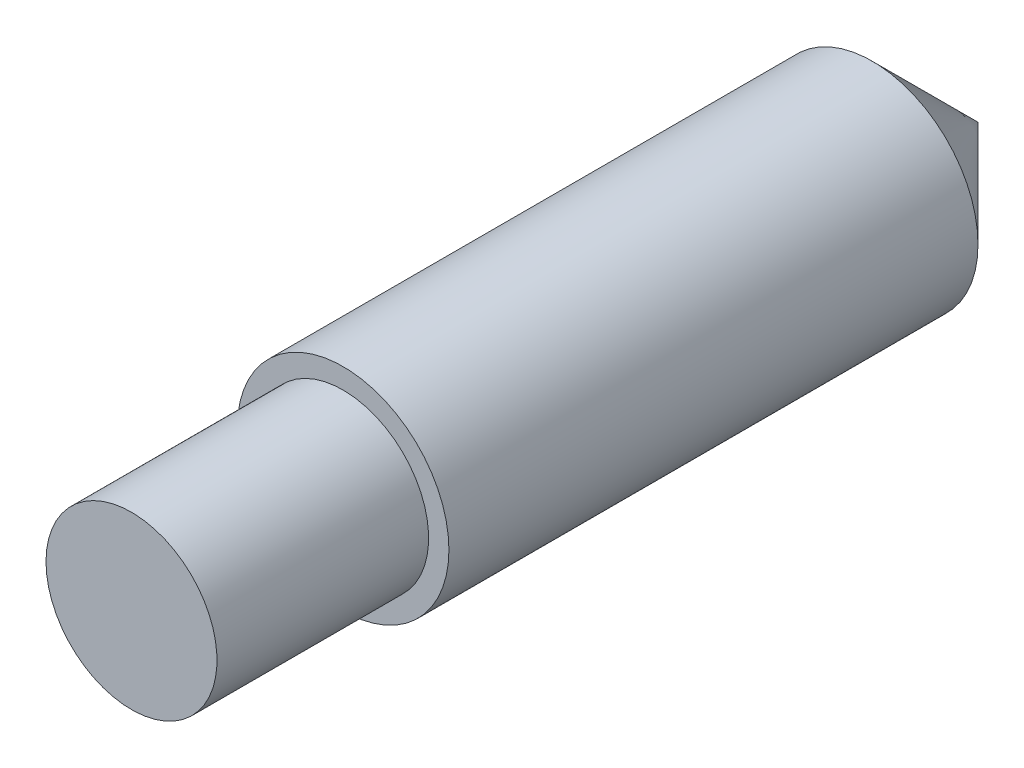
ISO-10303-21;
HEADER;
FILE_DESCRIPTION(('STEP AP214'),'2;1');
FILE_NAME('part.step','',(''),(''),'','','');
FILE_SCHEMA(('AUTOMOTIVE_DESIGN { 1 0 10303 214 1 1 1 1 }'));
ENDSEC;
DATA;
#1=APPLICATION_CONTEXT('core data for automotive mechanical design processes');
#2=APPLICATION_PROTOCOL_DEFINITION('international standard','automotive_design',2000,#1);
#3=PRODUCT_CONTEXT('',#1,'mechanical');
#4=PRODUCT('Part','Part','',(#3));
#5=PRODUCT_RELATED_PRODUCT_CATEGORY('part','',(#4));
#6=PRODUCT_DEFINITION_FORMATION('','',#4);
#7=PRODUCT_DEFINITION_CONTEXT('part definition',#1,'design');
#8=PRODUCT_DEFINITION('design','',#6,#7);
#9=PRODUCT_DEFINITION_SHAPE('','',#8);
#10=(LENGTH_UNIT() NAMED_UNIT(*) SI_UNIT(.MILLI.,.METRE.));
#11=(NAMED_UNIT(*) PLANE_ANGLE_UNIT() SI_UNIT($,.RADIAN.));
#12=(NAMED_UNIT(*) SI_UNIT($,.STERADIAN.) SOLID_ANGLE_UNIT());
#13=UNCERTAINTY_MEASURE_WITH_UNIT(LENGTH_MEASURE(1.E-05),#10,'distance_accuracy_value','');
#14=(GEOMETRIC_REPRESENTATION_CONTEXT(3) GLOBAL_UNCERTAINTY_ASSIGNED_CONTEXT((#13)) GLOBAL_UNIT_ASSIGNED_CONTEXT((#10,
#11,#12)) REPRESENTATION_CONTEXT('',''));
#15=CARTESIAN_POINT('',(0.,0.,0.));
#16=DIRECTION('',(0.,0.,1.));
#17=DIRECTION('',(1.,0.,0.));
#18=AXIS2_PLACEMENT_3D('',#15,#16,#17);
#19=CARTESIAN_POINT('',(0.,0.,0.));
#20=DIRECTION('',(0.,0.,1.));
#21=DIRECTION('',(1.,0.,0.));
#22=AXIS2_PLACEMENT_3D('',#19,#20,#21);
#23=PLANE('',#22);
#24=CARTESIAN_POINT('',(0.,0.,0.));
#25=DIRECTION('',(0.,0.,-1.));
#26=DIRECTION('',(-1.,0.,0.));
#27=AXIS2_PLACEMENT_3D('',#24,#25,#26);
#28=CIRCLE('',#27,1.2827);
#29=CARTESIAN_POINT('',(-1.2827,0.,0.));
#30=VERTEX_POINT('',#29);
#31=EDGE_CURVE('E11',#30,#30,#28,.T.);
#32=ORIENTED_EDGE('',*,*,#31,.F.);
#33=EDGE_LOOP('',(#32));
#34=FACE_BOUND('',#33,.T.);
#35=ADVANCED_FACE('F31',(#34),#23,.T.);
#36=CARTESIAN_POINT('',(0.,0.,0.));
#37=DIRECTION('',(0.,0.,-1.));
#38=DIRECTION('',(-1.,0.,0.));
#39=AXIS2_PLACEMENT_3D('',#36,#37,#38);
#40=CYLINDRICAL_SURFACE('',#39,1.2827);
#41=ORIENTED_EDGE('',*,*,#31,.T.);
#42=EDGE_LOOP('',(#41));
#43=FACE_BOUND('',#42,.T.);
#44=CARTESIAN_POINT('',(0.,0.,-3.175));
#45=DIRECTION('',(0.,0.,-1.));
#46=DIRECTION('',(-1.,0.,0.));
#47=AXIS2_PLACEMENT_3D('',#44,#45,#46);
#48=CIRCLE('',#47,1.2827);
#49=CARTESIAN_POINT('',(-1.2827,0.,-3.175));
#50=VERTEX_POINT('',#49);
#51=EDGE_CURVE('E37',#50,#50,#48,.T.);
#52=ORIENTED_EDGE('',*,*,#51,.F.);
#53=EDGE_LOOP('',(#52));
#54=FACE_BOUND('',#53,.T.);
#55=ADVANCED_FACE('F53',(#43,#54),#40,.T.);
#56=CARTESIAN_POINT('',(0.,1.2827,-3.175));
#57=DIRECTION('',(0.,0.,1.));
#58=DIRECTION('',(1.,0.,0.));
#59=AXIS2_PLACEMENT_3D('',#56,#57,#58);
#60=PLANE('',#59);
#61=ORIENTED_EDGE('',*,*,#51,.T.);
#62=EDGE_LOOP('',(#61));
#63=FACE_BOUND('',#62,.T.);
#64=CARTESIAN_POINT('',(0.,0.,-3.175));
#65=DIRECTION('',(0.,0.,-1.));
#66=DIRECTION('',(-1.,0.,0.));
#67=AXIS2_PLACEMENT_3D('',#64,#65,#66);
#68=CIRCLE('',#67,1.5875);
#69=CARTESIAN_POINT('',(-1.5875,0.,-3.175));
#70=VERTEX_POINT('',#69);
#71=EDGE_CURVE('E64',#70,#70,#68,.T.);
#72=ORIENTED_EDGE('',*,*,#71,.F.);
#73=EDGE_LOOP('',(#72));
#74=FACE_BOUND('',#73,.T.);
#75=ADVANCED_FACE('F48',(#63,#74),#60,.T.);
#76=CARTESIAN_POINT('',(0.,0.,0.));
#77=DIRECTION('',(0.,0.,-1.));
#78=DIRECTION('',(-1.,0.,0.));
#79=AXIS2_PLACEMENT_3D('',#76,#77,#78);
#80=CYLINDRICAL_SURFACE('',#79,1.5875);
#81=ORIENTED_EDGE('',*,*,#71,.T.);
#82=EDGE_LOOP('',(#81));
#83=FACE_BOUND('',#82,.T.);
#84=CARTESIAN_POINT('',(0.,0.,-11.1125));
#85=DIRECTION('',(0.,0.,-1.));
#86=DIRECTION('',(-1.,0.,0.));
#87=AXIS2_PLACEMENT_3D('',#84,#85,#86);
#88=CIRCLE('',#87,1.5875);
#89=CARTESIAN_POINT('',(-1.5875,0.,-11.1125));
#90=VERTEX_POINT('',#89);
#91=EDGE_CURVE('E66',#90,#90,#88,.T.);
#92=ORIENTED_EDGE('',*,*,#91,.F.);
#93=EDGE_LOOP('',(#92));
#94=FACE_BOUND('',#93,.T.);
#95=ADVANCED_FACE('F42',(#83,#94),#80,.T.);
#96=CARTESIAN_POINT('',(0.,0.,-12.7));
#97=DIRECTION('',(0.,0.,1.));
#98=DIRECTION('',(1.,0.,0.));
#99=AXIS2_PLACEMENT_3D('',#96,#97,#98);
#100=CONICAL_SURFACE('',#99,0.,0.78539816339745);
#101=ORIENTED_EDGE('',*,*,#91,.T.);
#102=EDGE_LOOP('',(#101));
#103=FACE_BOUND('',#102,.T.);
#104=CARTESIAN_POINT('',(0.,0.,-12.7));
#105=VERTEX_POINT('',#104);
#106=VERTEX_LOOP('',#105);
#107=FACE_BOUND('',#106,.T.);
#108=ADVANCED_FACE('F40',(#103,#107),#100,.T.);
#109=CLOSED_SHELL('',(#35,#55,#75,#95,#108));
#110=MANIFOLD_SOLID_BREP('B2',#109);
#111=ADVANCED_BREP_SHAPE_REPRESENTATION('',(#18,#110),#14);
#112=SHAPE_DEFINITION_REPRESENTATION(#9,#111);
ENDSEC;
END-ISO-10303-21;
